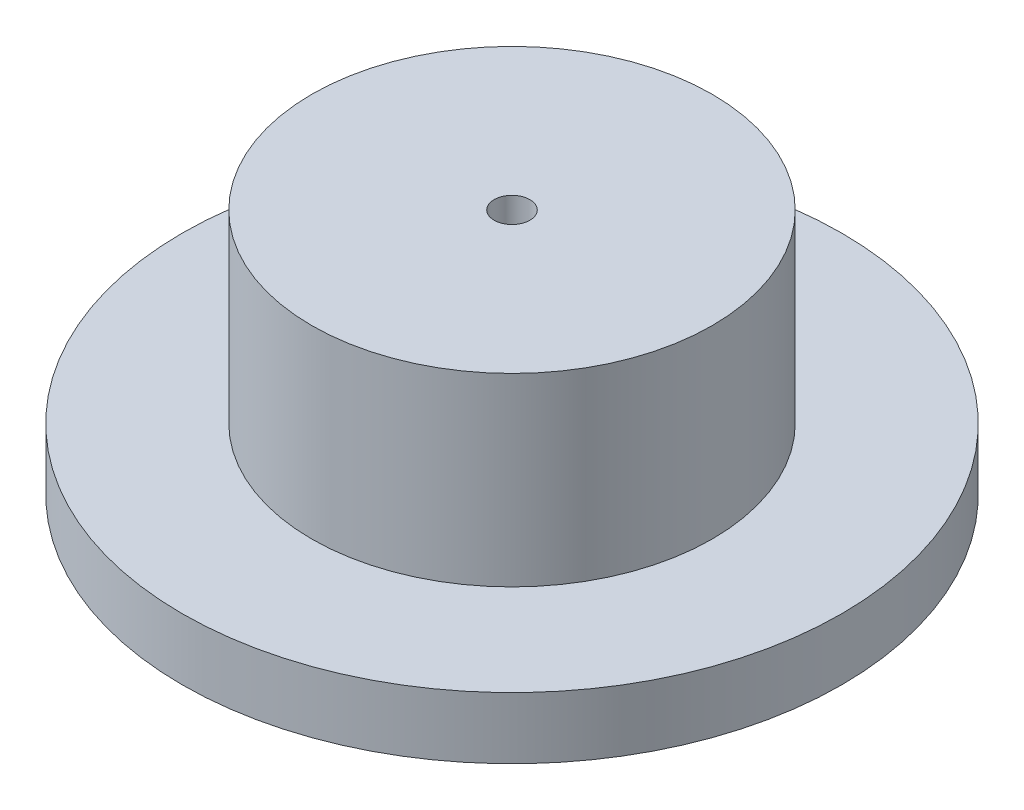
from build123d import *

# Parameters (mm, degrees)
SKETCH1_R           = 26.75
BOSS_EXTRUDE1_DEPTH = 5
SKETCH3_R           = 16.25
SKETCH3_R_2         = 1.451485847
BOSS_EXTRUDE3_DEPTH = 15


with BuildPart() as part:
    # Sketch1 → Boss-Extrude1 (new body)
    with BuildSketch(Plane(origin=(0, 0, 0), x_dir=(1, 0, 0), z_dir=(0, 1, 0))):
        with Locations(Location((0, 0, 0), (0, 0, 270))):
            Circle(SKETCH1_R)
    extrude(amount=BOSS_EXTRUDE1_DEPTH)

    # Sketch3 → Boss-Extrude3 (add)
    with BuildSketch(Plane(origin=(0, 5, 0), x_dir=(1, 0, 0), z_dir=(0, 1, 0))):
        with Locations(Location((0, 0, 0), (0, 0, 270))):
            Circle(SKETCH3_R)
        with Locations(Location((0, 0, 0), (0, 0, 270))):
            Circle(SKETCH3_R_2, mode=Mode.SUBTRACT)
    extrude(amount=BOSS_EXTRUDE3_DEPTH)


solid = part.part
